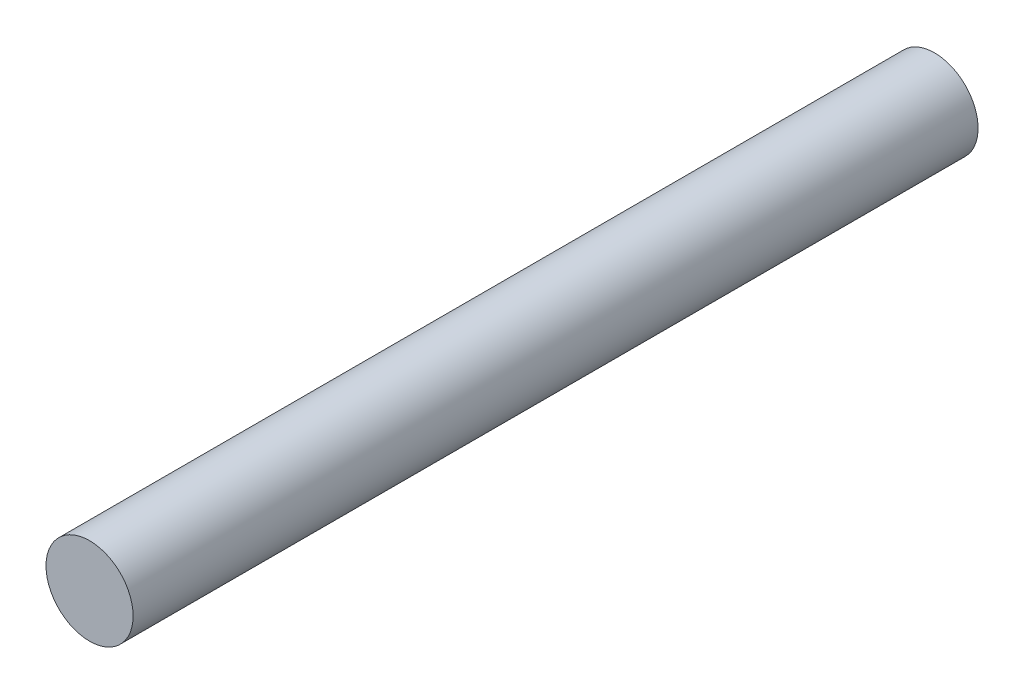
ISO-10303-21;
HEADER;
FILE_DESCRIPTION(('STEP AP214'),'2;1');
FILE_NAME('part.step','',(''),(''),'','','');
FILE_SCHEMA(('AUTOMOTIVE_DESIGN { 1 0 10303 214 1 1 1 1 }'));
ENDSEC;
DATA;
#1=APPLICATION_CONTEXT('core data for automotive mechanical design processes');
#2=APPLICATION_PROTOCOL_DEFINITION('international standard','automotive_design',2000,#1);
#3=PRODUCT_CONTEXT('',#1,'mechanical');
#4=PRODUCT('Part','Part','',(#3));
#5=PRODUCT_RELATED_PRODUCT_CATEGORY('part','',(#4));
#6=PRODUCT_DEFINITION_FORMATION('','',#4);
#7=PRODUCT_DEFINITION_CONTEXT('part definition',#1,'design');
#8=PRODUCT_DEFINITION('design','',#6,#7);
#9=PRODUCT_DEFINITION_SHAPE('','',#8);
#10=(LENGTH_UNIT() NAMED_UNIT(*) SI_UNIT(.MILLI.,.METRE.));
#11=(NAMED_UNIT(*) PLANE_ANGLE_UNIT() SI_UNIT($,.RADIAN.));
#12=(NAMED_UNIT(*) SI_UNIT($,.STERADIAN.) SOLID_ANGLE_UNIT());
#13=UNCERTAINTY_MEASURE_WITH_UNIT(LENGTH_MEASURE(1.E-05),#10,'distance_accuracy_value','');
#14=(GEOMETRIC_REPRESENTATION_CONTEXT(3) GLOBAL_UNCERTAINTY_ASSIGNED_CONTEXT((#13)) GLOBAL_UNIT_ASSIGNED_CONTEXT((#10,
#11,#12)) REPRESENTATION_CONTEXT('',''));
#15=CARTESIAN_POINT('',(0.,0.,0.));
#16=DIRECTION('',(0.,0.,1.));
#17=DIRECTION('',(1.,0.,0.));
#18=AXIS2_PLACEMENT_3D('',#15,#16,#17);
#19=CARTESIAN_POINT('',(-2.53,-2.53,0.));
#20=DIRECTION('',(0.,0.,1.));
#21=DIRECTION('',(1.,0.,0.));
#22=AXIS2_PLACEMENT_3D('',#19,#20,#21);
#23=PLANE('',#22);
#24=CARTESIAN_POINT('',(0.,0.,0.));
#25=DIRECTION('',(0.,0.,-1.));
#26=DIRECTION('',(-1.,0.,0.));
#27=AXIS2_PLACEMENT_3D('',#24,#25,#26);
#28=CIRCLE('',#27,2.5);
#29=CARTESIAN_POINT('',(-2.5,0.,0.));
#30=VERTEX_POINT('',#29);
#31=EDGE_CURVE('E8',#30,#30,#28,.T.);
#32=ORIENTED_EDGE('',*,*,#31,.T.);
#33=EDGE_LOOP('',(#32));
#34=FACE_BOUND('',#33,.T.);
#35=ADVANCED_FACE('F12',(#34),#23,.F.);
#36=CARTESIAN_POINT('',(0.,0.,46.5));
#37=DIRECTION('',(0.,0.,-1.));
#38=DIRECTION('',(-1.,0.,0.));
#39=AXIS2_PLACEMENT_3D('',#36,#37,#38);
#40=CYLINDRICAL_SURFACE('',#39,2.5);
#41=ORIENTED_EDGE('',*,*,#31,.F.);
#42=EDGE_LOOP('',(#41));
#43=FACE_BOUND('',#42,.T.);
#44=CARTESIAN_POINT('',(0.,0.,48.5));
#45=DIRECTION('',(0.,0.,1.));
#46=DIRECTION('',(1.,0.,0.));
#47=AXIS2_PLACEMENT_3D('',#44,#45,#46);
#48=CIRCLE('',#47,2.5);
#49=CARTESIAN_POINT('',(2.5,0.,48.5));
#50=VERTEX_POINT('',#49);
#51=EDGE_CURVE('E18',#50,#50,#48,.T.);
#52=ORIENTED_EDGE('',*,*,#51,.F.);
#53=EDGE_LOOP('',(#52));
#54=FACE_BOUND('',#53,.T.);
#55=ADVANCED_FACE('F26',(#43,#54),#40,.T.);
#56=CARTESIAN_POINT('',(0.,0.,48.5));
#57=DIRECTION('',(0.,0.,1.));
#58=DIRECTION('',(1.,0.,0.));
#59=AXIS2_PLACEMENT_3D('',#56,#57,#58);
#60=PLANE('',#59);
#61=ORIENTED_EDGE('',*,*,#51,.T.);
#62=EDGE_LOOP('',(#61));
#63=FACE_BOUND('',#62,.T.);
#64=ADVANCED_FACE('F24',(#63),#60,.T.);
#65=CLOSED_SHELL('',(#35,#55,#64));
#66=MANIFOLD_SOLID_BREP('B1',#65);
#67=ADVANCED_BREP_SHAPE_REPRESENTATION('',(#18,#66),#14);
#68=SHAPE_DEFINITION_REPRESENTATION(#9,#67);
ENDSEC;
END-ISO-10303-21;
